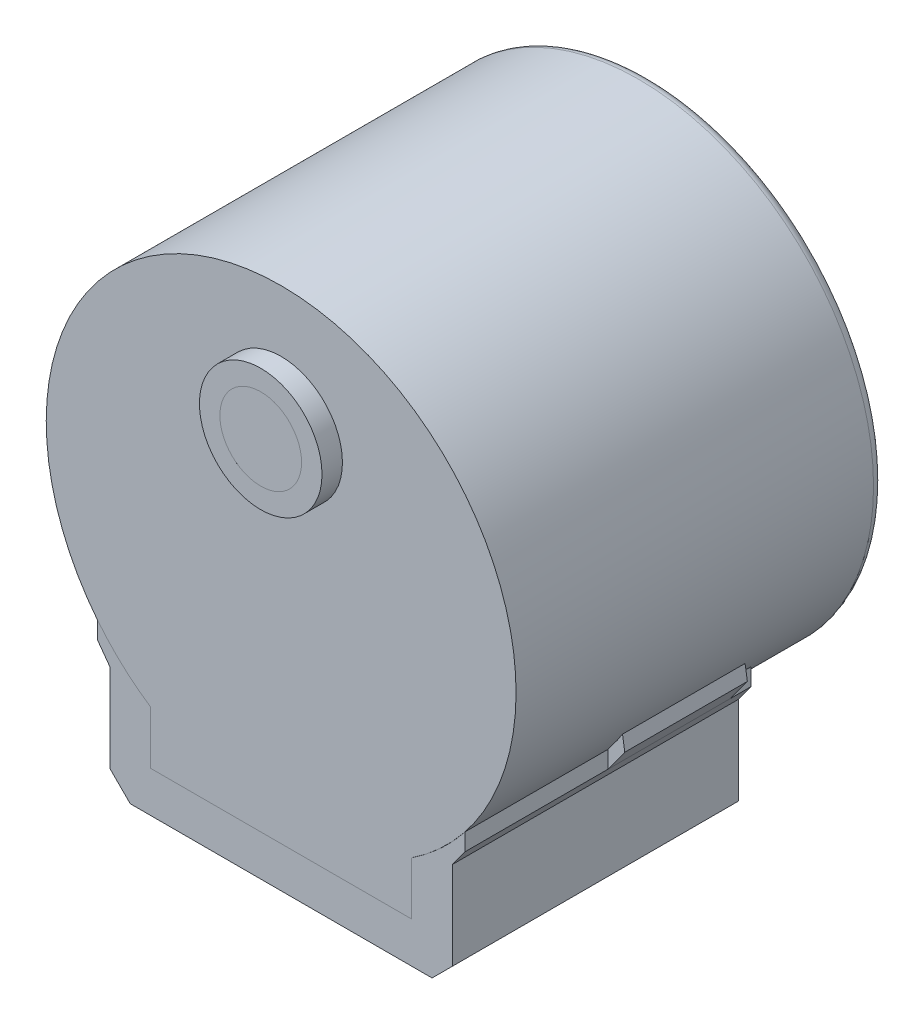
from build123d import *

# Parameters (mm, degrees)
SKETCH1_R             = 11.5
BOSS_EXTRUDE1_DEPTH   = 18
BOSS_EXTRUDE4_DEPTH   = 14
CHAMFER2_SIZE         = 1
BOSS_EXTRUDE5_DEPTH   = 6
BOSS_EXTRUDE5_2_DEPTH = 6
FILLET1_R             = 0.5
BOSS_EXTRUDE9_DEPTH   = 0.0001
SKETCH10_R            = 3
BOSS_EXTRUDE10_DEPTH  = 1
SKETCH12_R            = 2
CUT_EXTRUDE2_DEPTH    = 1
SKETCH6_R             = 3
BOSS_EXTRUDE6_DEPTH   = 1
SKETCH13_R            = 10.326369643
BOSS_EXTRUDE11_DEPTH  = 0.001
BOSS_EXTRUDE13_DEPTH  = 0.0001
BOSS_EXTRUDE14_DEPTH  = 0.0001
BOSS_EXTRUDE15_DEPTH  = 0.0001


with BuildPart() as part:
    # Sketch1 → Boss-Extrude1 (new body)
    with BuildSketch(Plane.XY):
        Circle(SKETCH1_R)
    extrude(amount=BOSS_EXTRUDE1_DEPTH)

    # Sketch2 → Boss-Extrude4 (add)
    with BuildSketch(Plane.XY.offset(18)):
        Polygon((-9, -7.158910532), (9, -7.158910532), (9, -8.001421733), (8.388098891, -8.843932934), (8.388098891, -14.158910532), (-8.388098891, -14.158910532), (-8.388098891, -8.843932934), (-9, -8.001421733), align=None)
    extrude(amount=-BOSS_EXTRUDE4_DEPTH)

    # Chamfer2
    chamfer2_edges = [part.edges().sort_by_distance(p)[0] for p in [
        (8.388098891, -14.158910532, 11),
        (-8.388098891, -14.158910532, 11),
    ]]
    chamfer(chamfer2_edges, length=CHAMFER2_SIZE)

    # Fillet1
    fillet1_edges = [part.edges().sort_by_distance(p)[0] for p in [
        (-11.5, 0, 0),
    ]]
    fillet(fillet1_edges, radius=FILLET1_R)

    # Sketch9 → Boss-Extrude9 (add)
    with BuildSketch(Plane.XY.offset(18)):
        with BuildLine():
            Line((-6.388098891, -9.562541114), (-6.388098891, -12.158910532))
            Line((-6.388098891, -12.158910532), (6.388098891, -12.158910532))
            Line((6.388098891, -12.158910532), (6.388098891, -9.562541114))
            ThreePointArc((6.388098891, -9.562541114), (0, 11.5), (-6.388098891, -9.562541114))
        make_face()
    extrude(amount=BOSS_EXTRUDE9_DEPTH)

    # Sketch10 → Boss-Extrude10 (add)
    with BuildSketch(Plane.XY.offset(18.0001)):
        with Locations((0, 5.5)):
            Circle(SKETCH10_R)
    extrude(amount=BOSS_EXTRUDE10_DEPTH)

    # Sketch12 → Cut-Extrude2 (cut)
    with BuildSketch(Plane.XY.offset(19.0001)):
        with Locations((0, 5.5)):
            Circle(SKETCH12_R)
    extrude(amount=-CUT_EXTRUDE2_DEPTH, mode=Mode.SUBTRACT)

    # Sketch6 → Boss-Extrude6 (add)
    with BuildSketch(Plane.XY.offset(18)):
        with Locations((0, 5.5)):
            Circle(SKETCH6_R)
    extrude(amount=BOSS_EXTRUDE6_DEPTH)

    # Sketch13 → Boss-Extrude11 (add)
    with BuildSketch(Plane(origin=(0, 0, 0), x_dir=(-1, 0, 0), z_dir=(0, 0, -1))):
        with Locations(Location((0, 0, 0), (0, 0, 180))):
            Circle(SKETCH13_R)
    extrude(amount=BOSS_EXTRUDE11_DEPTH)

    # Sketch15 → Boss-Extrude13 (add)
    # profile 1 of 4: a face of its own
    with BuildSketch(Plane(origin=(0, 0, -0.001), x_dir=(-1, 0, 0), z_dir=(0, 0, -1))):
        with BuildLine():
            Line((-3.525948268, 2.886972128), (-3.0540933, 2.886972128))
            add(Edge.make_bspline(
                [(-3.0540933, 2.886972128), (-3.022543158, 2.886821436), (-2.962239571, 2.886533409), (-2.875485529, 2.88481025), (-2.796763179, 2.880101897), (-2.725820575, 2.875989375), (-2.663254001, 2.868436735), (-2.608367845, 2.861342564), (-2.56123852, 2.851756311), (-2.532876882, 2.843220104), (-2.519838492, 2.839295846)],
                knots=[0, 0, 0, 0, 1.407275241, 2.689805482, 3.869373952, 4.924720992, 5.858292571, 6.679408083, 7.392898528, 8, 8, 8, 8], degree=3))
            add(Edge.make_bspline(
                [(-2.519838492, 2.839295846), (-2.502604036, 2.832914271), (-2.467997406, 2.820100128), (-2.418974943, 2.793550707), (-2.37188824, 2.762822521), (-2.327272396, 2.726853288), (-2.286048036, 2.684987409), (-2.246624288, 2.638786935), (-2.21003462, 2.587031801), (-2.176143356, 2.53076706), (-2.144861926, 2.470330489), (-2.11886731, 2.405749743), (-2.095040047, 2.338412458), (-2.07746815, 2.26712436), (-2.062228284, 2.193085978), (-2.053000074, 2.115211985), (-2.046279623, 2.034292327), (-2.045549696, 1.979034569), (-2.045179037, 1.950974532)],
                knots=[0, 0, 0, 0, 0.821157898, 1.648877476, 2.486832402, 3.334190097, 4.20646043, 5.111323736, 6.04828789, 7.037949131, 8.047833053, 9.088416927, 10.149643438, 11.239924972, 12.369590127, 13.528810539, 14.745123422, 16, 16, 16, 16], degree=3))
            add(Edge.make_bspline(
                [(-2.045179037, 1.950974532), (-2.046116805, 1.904405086), (-2.047938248, 1.813952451), (-2.066022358, 1.682720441), (-2.094477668, 1.560029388), (-2.134073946, 1.446505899), (-2.184228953, 1.343791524), (-2.244722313, 1.253250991), (-2.316337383, 1.177008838), (-2.383651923, 1.123712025), (-2.443252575, 1.088860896), (-2.491924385, 1.065731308), (-2.545021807, 1.047222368), (-2.601524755, 1.030643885), (-2.66230531, 1.018402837), (-2.72714964, 1.009288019), (-2.795981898, 1.003635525), (-2.843278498, 1.002790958), (-2.867594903, 1.002356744)],
                knots=[0, 0, 0, 0, 1.559350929, 3.028754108, 4.428415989, 5.773036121, 7.047604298, 8.248499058, 9.406249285, 10.538623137, 11.110667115, 11.716589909, 12.340703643, 12.992445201, 13.688047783, 14.415527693, 15.185381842, 16, 16, 16, 16], degree=3))
            Line((-2.867594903, 1.002356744), (-2.000307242, -0.613027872))
            Line((-2.000307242, -0.613027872), (-2.284962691, -0.613027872))
            Line((-2.284962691, -0.613027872), (-3.152250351, 1.002356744))
            Line((-3.152250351, 1.002356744), (-3.301589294, 1.002356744))
            Line((-3.301589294, 1.002356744), (-3.301589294, -0.613027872))
            Line((-3.301589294, -0.613027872), (-3.525948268, -0.613027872))
            Line((-3.525948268, -0.613027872), (-3.525948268, 2.886972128))
        make_face()
        with BuildLine():
            Line((-3.301589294, 2.527997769), (-3.301589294, 1.361331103))
            Line((-3.301589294, 1.361331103), (-2.880215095, 1.35642325))
            add(Edge.make_bspline(
                [(-2.880215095, 1.35642325), (-2.842090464, 1.357196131), (-2.770770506, 1.358641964), (-2.671720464, 1.369876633), (-2.588225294, 1.389569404), (-2.518805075, 1.418568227), (-2.461788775, 1.458386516), (-2.411484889, 1.505773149), (-2.369914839, 1.564588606), (-2.33317962, 1.630891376), (-2.305485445, 1.704827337), (-2.283683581, 1.78328458), (-2.272141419, 1.866263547), (-2.27041514, 1.922898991), (-2.269538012, 1.951675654)],
                knots=[0, 0, 0, 0, 1.395459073, 2.610493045, 3.641753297, 4.526968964, 5.345645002, 6.17462708, 7.043906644, 7.970450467, 8.942786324, 9.926497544, 10.946446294, 12, 12, 12, 12], degree=3))
            add(Edge.make_bspline(
                [(-2.269538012, 1.951675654), (-2.270296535, 1.979776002), (-2.271789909, 2.035099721), (-2.285050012, 2.115850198), (-2.304755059, 2.193128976), (-2.334707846, 2.264641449), (-2.369232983, 2.33034316), (-2.411159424, 2.386339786), (-2.457612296, 2.433014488), (-2.512091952, 2.469911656), (-2.57845377, 2.49725898), (-2.660457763, 2.514888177), (-2.759506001, 2.52684396), (-2.831559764, 2.527593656), (-2.87039939, 2.527997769)],
                knots=[0, 0, 0, 0, 1.050889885, 2.068982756, 3.055515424, 4.02842232, 4.963806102, 5.826211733, 6.636431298, 7.417566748, 8.27204102, 9.305238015, 10.547424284, 12, 12, 12, 12], degree=3))
            Line((-2.87039939, 2.527997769), (-3.301589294, 2.527997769))
        make_face(mode=Mode.SUBTRACT)
    # profile 2 of 4: a face of its own
    with BuildSketch(Plane(origin=(0, 0, -0.001), x_dir=(-1, 0, 0), z_dir=(0, 0, -1))):
        with BuildLine():
            add(Edge.make_bspline(
                [(-0.743195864, 1.989536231), (-0.710589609, 1.988507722), (-0.64634692, 1.986481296), (-0.552508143, 1.964760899), (-0.462871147, 1.931773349), (-0.37694895, 1.885938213), (-0.296812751, 1.82519744), (-0.220680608, 1.752049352), (-0.147904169, 1.66643579), (-0.105858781, 1.601633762), (-0.084141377, 1.568162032)],
                knots=[0, 0, 0, 0, 0.953316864, 1.878278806, 2.805087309, 3.745143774, 4.718373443, 5.739791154, 6.832550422, 8, 8, 8, 8], degree=3))
            add(Edge.make_bspline(
                [(-0.084141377, 1.568162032), (-0.065135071, 1.535730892), (-0.026928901, 1.47053834), (0.020643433, 1.367200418), (0.062925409, 1.260359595), (0.095391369, 1.148214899), (0.121237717, 1.032040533), (0.140321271, 0.911490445), (0.15173039, 0.786634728), (0.152930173, 0.701833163), (0.153538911, 0.658807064)],
                knots=[0, 0, 0, 0, 0.947011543, 1.903667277, 2.864215, 3.840975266, 4.842905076, 5.862773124, 6.915626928, 8, 8, 8, 8], degree=3))
            add(Edge.make_bspline(
                [(0.153538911, 0.658807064), (0.152619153, 0.615551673), (0.150806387, 0.530298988), (0.139799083, 0.404429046), (0.119809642, 0.282718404), (0.093087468, 0.164844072), (0.056470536, 0.051597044), (0.014464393, -0.058142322), (-0.03757542, -0.162959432), (-0.095405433, -0.263003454), (-0.159659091, -0.354954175), (-0.229469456, -0.435523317), (-0.303185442, -0.504540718), (-0.382558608, -0.560475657), (-0.466219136, -0.604274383), (-0.554422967, -0.635628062), (-0.647294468, -0.65425469), (-0.710859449, -0.656670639), (-0.743195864, -0.657899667)],
                knots=[0, 0, 0, 0, 1.179143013, 2.323990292, 3.440410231, 4.539095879, 5.614957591, 6.682013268, 7.739000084, 8.801004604, 9.829641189, 10.791486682, 11.702119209, 12.575235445, 13.43003252, 14.26821791, 15.119017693, 16, 16, 16, 16], degree=3))
            add(Edge.make_bspline(
                [(-0.743195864, -0.657899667), (-0.775532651, -0.656661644), (-0.839327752, -0.654219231), (-0.932631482, -0.635578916), (-1.021256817, -0.60461203), (-1.104674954, -0.560270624), (-1.183949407, -0.504348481), (-1.258326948, -0.435775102), (-1.328102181, -0.354918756), (-1.392392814, -0.263012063), (-1.450236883, -0.162962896), (-1.502181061, -0.058119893), (-1.544534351, 0.051444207), (-1.57973647, 0.165093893), (-1.607906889, 0.282587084), (-1.627507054, 0.404450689), (-1.638622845, 0.530293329), (-1.640420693, 0.615549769), (-1.641332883, 0.658807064)],
                knots=[0, 0, 0, 0, 0.880385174, 1.73685346, 2.58047298, 3.429050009, 4.301574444, 5.216276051, 6.177469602, 7.205408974, 8.266693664, 9.322964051, 10.389296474, 11.462523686, 12.56192169, 13.677584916, 14.821656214, 16, 16, 16, 16], degree=3))
            add(Edge.make_bspline(
                [(-1.641332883, 0.658807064), (-1.640718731, 0.701599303), (-1.639505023, 0.786166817), (-1.628106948, 0.910788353), (-1.609097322, 1.03111742), (-1.583231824, 1.14683842), (-1.550405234, 1.258609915), (-1.508802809, 1.365486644), (-1.460648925, 1.46856849), (-1.422622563, 1.533611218), (-1.403652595, 1.566058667)],
                knots=[0, 0, 0, 0, 1.08079722, 2.135909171, 3.15796462, 4.156281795, 5.129476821, 6.097590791, 7.050957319, 8, 8, 8, 8], degree=3))
            add(Edge.make_bspline(
                [(-1.403652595, 1.566058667), (-1.381987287, 1.599807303), (-1.340140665, 1.664992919), (-1.266812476, 1.750557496), (-1.191221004, 1.82483722), (-1.109984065, 1.884851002), (-1.024458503, 1.931953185), (-0.934343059, 1.964820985), (-0.840269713, 1.986426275), (-0.775800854, 1.988491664), (-0.743195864, 1.989536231)],
                knots=[0, 0, 0, 0, 1.169336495, 2.258577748, 3.281427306, 4.257001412, 5.197279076, 6.121103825, 7.049752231, 8, 8, 8, 8], degree=3))
        make_face()
        with BuildLine():
            add(Edge.make_bspline(
                [(-0.743896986, 1.675433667), (-0.766642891, 1.674472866), (-0.811637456, 1.67257227), (-0.877710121, 1.657849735), (-0.941216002, 1.634686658), (-1.002359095, 1.601884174), (-1.060621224, 1.55920574), (-1.11685676, 1.507777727), (-1.170439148, 1.446908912), (-1.220012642, 1.377226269), (-1.265938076, 1.301295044), (-1.306866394, 1.220902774), (-1.340185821, 1.136140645), (-1.368742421, 1.048014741), (-1.390226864, 0.955565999), (-1.40528395, 0.859236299), (-1.41584218, 0.759300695), (-1.416592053, 0.69132088), (-1.416973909, 0.656703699)],
                knots=[0, 0, 0, 0, 0.812010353, 1.606269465, 2.406649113, 3.220974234, 4.076097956, 4.98035605, 5.938625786, 6.967482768, 8.03141706, 9.10682197, 10.18594796, 11.281773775, 12.413897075, 13.572437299, 14.763818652, 16, 16, 16, 16], degree=3))
            add(Edge.make_bspline(
                [(-1.416973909, 0.656703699), (-1.415901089, 0.61201679), (-1.41378136, 0.523722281), (-1.396790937, 0.393577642), (-1.367702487, 0.268415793), (-1.329065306, 0.149221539), (-1.280556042, 0.038807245), (-1.223240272, -0.059604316), (-1.158394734, -0.145316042), (-1.085332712, -0.216424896), (-1.006170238, -0.273057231), (-0.922206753, -0.313456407), (-0.834526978, -0.339868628), (-0.774230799, -0.342482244), (-0.743896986, -0.343797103)],
                knots=[0, 0, 0, 0, 1.20838902, 2.38759222, 3.542210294, 4.679604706, 5.771967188, 6.797545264, 7.753349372, 8.669734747, 9.544904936, 10.373258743, 11.181618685, 12, 12, 12, 12], degree=3))
            add(Edge.make_bspline(
                [(-0.743896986, -0.343797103), (-0.713561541, -0.34248469), (-0.65326212, -0.339875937), (-0.565606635, -0.313427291), (-0.481719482, -0.273254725), (-0.403071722, -0.216200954), (-0.330130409, -0.145129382), (-0.264463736, -0.059848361), (-0.207285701, 0.038842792), (-0.158714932, 0.149211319), (-0.120095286, 0.268418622), (-0.091001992, 0.393576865), (-0.074012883, 0.523722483), (-0.071892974, 0.612016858), (-0.070820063, 0.656703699)],
                knots=[0, 0, 0, 0, 0.81846946, 1.626916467, 2.455359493, 3.325471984, 4.241956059, 5.201722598, 6.227411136, 7.319891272, 8.457408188, 9.612150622, 10.791480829, 12, 12, 12, 12], degree=3))
            add(Edge.make_bspline(
                [(-0.070820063, 0.656703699), (-0.071201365, 0.691321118), (-0.071950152, 0.759301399), (-0.082516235, 0.859233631), (-0.097544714, 0.955575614), (-0.119132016, 1.047980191), (-0.14734683, 1.136347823), (-0.182014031, 1.220513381), (-0.221558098, 1.301702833), (-0.268571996, 1.377214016), (-0.31872674, 1.446765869), (-0.372323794, 1.507534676), (-0.427904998, 1.559427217), (-0.486162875, 1.601854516), (-0.547272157, 1.634694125), (-0.610786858, 1.657848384), (-0.676628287, 1.672519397), (-0.721386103, 1.674458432), (-0.743896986, 1.675433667)],
                knots=[0, 0, 0, 0, 1.236632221, 2.428448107, 3.587410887, 4.719947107, 5.816172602, 6.898822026, 7.970883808, 9.039556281, 10.073691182, 11.032310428, 11.93074605, 12.786181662, 13.600803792, 14.401475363, 15.196024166, 16, 16, 16, 16], degree=3))
        make_face(mode=Mode.SUBTRACT)
    # profile 3 of 4: a face of its own
    with BuildSketch(Plane(origin=(0, 0, -0.001), x_dir=(-1, 0, 0), z_dir=(0, 0, -1))):
        Polygon((0.69200045, 2.886972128), (0.916359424, 2.886972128), (0.916359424, 1.451074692), (2.127897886, 1.451074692), (2.127897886, 2.886972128), (2.35225686, 2.886972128), (2.35225686, -0.613027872), (2.127897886, -0.613027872), (2.127897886, 1.092100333), (0.916359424, 1.092100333), (0.916359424, -0.613027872), (0.69200045, -0.613027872), align=None)
    # profile 4 of 4: a face of its own
    with BuildSketch(Plane(origin=(0, 0, -0.001), x_dir=(-1, 0, 0), z_dir=(0, 0, -1))):
        with BuildLine():
            Line((2.711231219, 0.062152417), (2.91455654, 0.239536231))
            add(Edge.make_bspline(
                [(2.91455654, 0.239536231), (2.933533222, 0.193666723), (2.969498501, 0.106733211), (3.030582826, -0.012164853), (3.09314987, -0.113625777), (3.159100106, -0.19622394), (3.226612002, -0.26207911), (3.297620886, -0.308665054), (3.371547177, -0.338400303), (3.422382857, -0.342016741), (3.447409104, -0.343797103)],
                knots=[0, 0, 0, 0, 1.4274707, 2.705392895, 3.841360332, 4.850387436, 5.739695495, 6.54155184, 7.282010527, 8, 8, 8, 8], degree=3))
            add(Edge.make_bspline(
                [(3.447409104, -0.343797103), (3.468781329, -0.342940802), (3.511394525, -0.34123346), (3.573948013, -0.324589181), (3.634791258, -0.29961567), (3.691944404, -0.263292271), (3.745336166, -0.219364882), (3.792361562, -0.167401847), (3.831977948, -0.108132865), (3.864714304, -0.043057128), (3.890203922, 0.026728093), (3.909272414, 0.098967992), (3.920990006, 0.173480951), (3.922171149, 0.223835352), (3.922769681, 0.249351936)],
                knots=[0, 0, 0, 0, 0.910355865, 1.815120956, 2.745047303, 3.708239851, 4.692884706, 5.688582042, 6.687272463, 7.726626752, 8.790156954, 9.852236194, 10.911642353, 12, 12, 12, 12], degree=3))
            add(Edge.make_bspline(
                [(3.922769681, 0.249351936), (3.921592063, 0.278395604), (3.919219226, 0.336917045), (3.902919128, 0.424050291), (3.874284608, 0.510009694), (3.84789866, 0.564886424), (3.834428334, 0.592901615)],
                knots=[0, 0, 0, 0, 0.973184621, 1.960915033, 2.959024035, 4, 4, 4, 4], degree=3))
            add(Edge.make_bspline(
                [(3.834428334, 0.592901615), (3.82343869, 0.612900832), (3.8005507, 0.65455294), (3.760186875, 0.716845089), (3.713582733, 0.782113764), (3.661347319, 0.850711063), (3.601832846, 0.92154823), (3.536813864, 0.995834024), (3.465248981, 1.072970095), (3.414589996, 1.124480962), (3.388514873, 1.150994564)],
                knots=[0, 0, 0, 0, 0.763930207, 1.591027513, 2.483480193, 3.449232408, 4.477278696, 5.580830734, 6.75480852, 8, 8, 8, 8], degree=3))
            add(Edge.make_bspline(
                [(3.388514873, 1.150994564), (3.36238899, 1.177227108), (3.312340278, 1.227480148), (3.243489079, 1.302319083), (3.18061586, 1.36972234), (3.126599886, 1.432552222), (3.079797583, 1.489069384), (3.039778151, 1.539351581), (3.009026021, 1.584984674), (2.991802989, 1.613901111), (2.983967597, 1.627056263)],
                knots=[0, 0, 0, 0, 1.418850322, 2.718056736, 3.897251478, 4.951422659, 5.8930247, 6.710073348, 7.413164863, 8, 8, 8, 8], degree=3))
            add(Edge.make_bspline(
                [(2.983967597, 1.627056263), (2.962706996, 1.668389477), (2.920354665, 1.7507276), (2.877664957, 1.882883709), (2.850290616, 2.019714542), (2.847339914, 2.112799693), (2.845846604, 2.159908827)],
                knots=[0, 0, 0, 0, 1.001108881, 1.994266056, 2.984925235, 4, 4, 4, 4], degree=3))
            add(Edge.make_bspline(
                [(2.845846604, 2.159908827), (2.846742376, 2.19688923), (2.848507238, 2.269748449), (2.863822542, 2.376265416), (2.887141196, 2.478247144), (2.921649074, 2.573727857), (2.964056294, 2.662456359), (3.014983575, 2.74180171), (3.074208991, 2.811129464), (3.140354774, 2.869938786), (3.21278064, 2.916988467), (3.288557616, 2.952119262), (3.368310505, 2.972408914), (3.422292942, 2.975272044), (3.449512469, 2.976715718)],
                knots=[0, 0, 0, 0, 1.181416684, 2.327640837, 3.432896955, 4.519774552, 5.565493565, 6.570422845, 7.524069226, 8.471345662, 9.389213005, 10.275123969, 11.130266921, 12, 12, 12, 12], degree=3))
            add(Edge.make_bspline(
                [(3.449512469, 2.976715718), (3.47841671, 2.975266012), (3.53651374, 2.972352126), (3.621742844, 2.947317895), (3.70329141, 2.906274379), (3.768163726, 2.860173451), (3.818490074, 2.814043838), (3.858027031, 2.772674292), (3.896803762, 2.723610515), (3.937906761, 2.669262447), (3.978012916, 2.607163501), (4.019781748, 2.539244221), (4.060670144, 2.463870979), (4.08807458, 2.4114148), (4.10225686, 2.384267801)],
                knots=[0, 0, 0, 0, 1.116951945, 2.245054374, 3.405965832, 4.638253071, 5.310557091, 6.04630686, 6.850074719, 7.729237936, 8.682511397, 9.709406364, 10.81457734, 12, 12, 12, 12], degree=3))
            Line((4.10225686, 2.384267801), (3.907345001, 2.16902341))
            add(Edge.make_bspline(
                [(3.907345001, 2.16902341), (3.895255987, 2.191026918), (3.872125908, 2.233126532), (3.837775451, 2.293256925), (3.804296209, 2.34702565), (3.771924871, 2.394899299), (3.741171, 2.437098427), (3.711726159, 2.473623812), (3.684038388, 2.504732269), (3.648678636, 2.537114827), (3.604443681, 2.569523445), (3.548315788, 2.597454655), (3.489520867, 2.614434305), (3.449387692, 2.61663385), (3.429179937, 2.617741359)],
                knots=[0, 0, 0, 0, 1.309793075, 2.506045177, 3.612360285, 4.613350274, 5.520539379, 6.33553705, 7.060566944, 7.690470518, 8.834311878, 9.908515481, 10.946901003, 12, 12, 12, 12], degree=3))
            add(Edge.make_bspline(
                [(3.429179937, 2.617741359), (3.403700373, 2.616511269), (3.354017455, 2.614112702), (3.283991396, 2.587729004), (3.22123389, 2.546800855), (3.168184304, 2.490079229), (3.123718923, 2.42324654), (3.093091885, 2.346538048), (3.073476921, 2.263022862), (3.071317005, 2.204662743), (3.070205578, 2.174632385)],
                knots=[0, 0, 0, 0, 0.957930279, 1.867880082, 2.78566855, 3.76545862, 4.778691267, 5.799579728, 6.867730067, 8, 8, 8, 8], degree=3))
            add(Edge.make_bspline(
                [(3.070205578, 2.174632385), (3.072077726, 2.137334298), (3.07581996, 2.062779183), (3.09818308, 1.970782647), (3.125880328, 1.897759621), (3.155352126, 1.841301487), (3.1903723, 1.781686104), (3.218278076, 1.742758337), (3.232865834, 1.722408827)],
                knots=[0, 0, 0, 0, 1.37118372, 2.740858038, 3.459154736, 4.239466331, 5.07968016, 6, 6, 6, 6], degree=3))
            add(Edge.make_bspline(
                [(3.232865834, 1.722408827), (3.238154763, 1.71555867), (3.250729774, 1.699271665), (3.274931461, 1.673318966), (3.305347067, 1.639509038), (3.343672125, 1.599737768), (3.388465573, 1.552236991), (3.441393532, 1.499276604), (3.500882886, 1.438877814), (3.542984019, 1.396376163), (3.565197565, 1.373951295)],
                knots=[0, 0, 0, 0, 0.430988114, 1.024721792, 1.76647773, 2.697202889, 3.776087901, 5.019389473, 6.42735995, 8, 8, 8, 8], degree=3))
            add(Edge.make_bspline(
                [(3.565197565, 1.373951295), (3.591978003, 1.346270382), (3.644064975, 1.292432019), (3.717840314, 1.211657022), (3.785360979, 1.133420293), (3.8455066, 1.056834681), (3.899835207, 0.983156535), (3.947760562, 0.911819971), (3.988542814, 0.842178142), (4.033883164, 0.753567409), (4.078471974, 0.643512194), (4.118610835, 0.511119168), (4.142535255, 0.377824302), (4.145604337, 0.288706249), (4.147128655, 0.244444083)],
                knots=[0, 0, 0, 0, 1.061650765, 2.064871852, 3.015192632, 3.909651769, 4.748487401, 5.538240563, 6.277422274, 6.971787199, 8.280588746, 9.544330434, 10.780345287, 12, 12, 12, 12], degree=3))
            add(Edge.make_bspline(
                [(4.147128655, 0.244444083), (4.146332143, 0.21311157), (4.144759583, 0.151251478), (4.13599318, 0.059965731), (4.119312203, -0.027971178), (4.098030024, -0.113305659), (4.069120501, -0.19532475), (4.033865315, -0.273934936), (3.993113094, -0.349728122), (3.945921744, -0.42085397), (3.894565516, -0.486493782), (3.839952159, -0.544392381), (3.782216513, -0.593299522), (3.721353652, -0.632923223), (3.657801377, -0.664108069), (3.591657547, -0.686650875), (3.522549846, -0.700643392), (3.475520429, -0.702054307), (3.451615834, -0.702771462)],
                knots=[0, 0, 0, 0, 1.158720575, 2.287673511, 3.385950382, 4.465299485, 5.536593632, 6.596465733, 7.64816921, 8.714678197, 9.748443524, 10.726384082, 11.652440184, 12.539243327, 13.404912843, 14.26295822, 15.117078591, 16, 16, 16, 16], degree=3))
            add(Edge.make_bspline(
                [(3.451615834, -0.702771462), (3.433114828, -0.702263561), (3.396386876, -0.701255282), (3.342235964, -0.69221577), (3.289098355, -0.679386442), (3.237953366, -0.65917584), (3.187674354, -0.634492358), (3.138611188, -0.604515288), (3.091418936, -0.568039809), (3.044882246, -0.526698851), (2.999579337, -0.478386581), (2.955739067, -0.422742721), (2.911959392, -0.360278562), (2.870354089, -0.289813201), (2.828748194, -0.21248503), (2.788491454, -0.127602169), (2.748099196, -0.035718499), (2.723779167, 0.02884223), (2.711231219, 0.062152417)],
                knots=[0, 0, 0, 0, 0.781108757, 1.550646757, 2.314652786, 3.086720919, 3.868391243, 4.679628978, 5.511108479, 6.385293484, 7.30741185, 8.305206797, 9.376292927, 10.527882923, 11.760494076, 13.085521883, 14.49627147, 16, 16, 16, 16], degree=3))
        make_face()
    extrude(amount=BOSS_EXTRUDE13_DEPTH)

    # Sketch16 → Boss-Extrude14 (add)
    # profile 1 of 7: a face of its own
    with BuildSketch(Plane(origin=(0, 0, -0.001), x_dir=(-1, 0, 0), z_dir=(0, 0, -1))):
        with BuildLine():
            Line((-2.92792156, 5.936670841), (-3.062536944, 5.936670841))
            add(Edge.make_bspline(
                [(-3.062536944, 5.936670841), (-3.061639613, 5.978280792), (-3.059884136, 6.059683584), (-3.0527546, 6.178701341), (-3.042513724, 6.292178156), (-3.027806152, 6.399760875), (-3.00945665, 6.501952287), (-2.988250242, 6.598549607), (-2.962047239, 6.689249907), (-2.932975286, 6.773583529), (-2.901319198, 6.850131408), (-2.867258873, 6.917256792), (-2.830570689, 6.973676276), (-2.793091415, 7.020898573), (-2.752632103, 7.05717834), (-2.710827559, 7.08411524), (-2.666192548, 7.100667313), (-2.635451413, 7.102449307), (-2.620129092, 7.103337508)],
                knots=[0, 0, 0, 0, 1.499044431, 2.932625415, 4.293837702, 5.602250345, 6.842368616, 8.033041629, 9.162785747, 10.241015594, 11.244734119, 12.144584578, 12.947813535, 13.665690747, 14.309565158, 14.895830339, 15.449648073, 16, 16, 16, 16], degree=3))
            add(Edge.make_bspline(
                [(-2.620129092, 7.103337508), (-2.60505573, 7.102393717), (-2.574878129, 7.100504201), (-2.531160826, 7.084992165), (-2.490667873, 7.059283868), (-2.451362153, 7.025375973), (-2.416201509, 6.98018603), (-2.382114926, 6.926309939), (-2.351200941, 6.862310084), (-2.311516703, 6.76328408), (-2.270172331, 6.625815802), (-2.234790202, 6.448125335), (-2.21369564, 6.256422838), (-2.211240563, 6.124158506), (-2.209972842, 6.055861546)],
                knots=[0, 0, 0, 0, 0.449190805, 0.899301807, 1.365979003, 1.875299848, 2.440824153, 3.06797826, 3.776272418, 4.558816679, 6.251583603, 8.052270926, 9.961522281, 12, 12, 12, 12], degree=3))
            add(Edge.make_bspline(
                [(-2.209972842, 6.055861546), (-2.21068331, 6.007000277), (-2.2120819, 5.910814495), (-2.222031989, 5.768760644), (-2.238518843, 5.631318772), (-2.259214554, 5.518932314), (-2.278702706, 5.427622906), (-2.297419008, 5.353928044), (-2.318079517, 5.274060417), (-2.343002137, 5.188683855), (-2.370084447, 5.097379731), (-2.401262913, 5.000792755), (-2.434786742, 4.898070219), (-2.458999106, 4.827928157), (-2.471491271, 4.79173895)],
                knots=[0, 0, 0, 0, 1.355088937, 2.66755837, 3.947484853, 5.192214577, 5.835517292, 6.536663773, 7.300749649, 8.123430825, 9.003169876, 9.942028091, 10.938206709, 12, 12, 12, 12], degree=3))
            Line((-2.471491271, 4.79173895), (-2.796110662, 3.872568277))
            Line((-2.796110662, 3.872568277), (-2.209972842, 3.872568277))
            Line((-2.209972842, 3.872568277), (-2.209972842, 3.513593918))
            Line((-2.209972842, 3.513593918), (-3.107408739, 3.513593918))
            Line((-3.107408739, 3.513593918), (-2.594888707, 4.962111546))
            add(Edge.make_bspline(
                [(-2.594888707, 4.962111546), (-2.582521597, 4.996706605), (-2.558634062, 5.063528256), (-2.523810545, 5.159961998), (-2.494101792, 5.25001932), (-2.466285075, 5.332758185), (-2.442750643, 5.408819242), (-2.422053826, 5.477901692), (-2.405258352, 5.540100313), (-2.387326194, 5.614207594), (-2.370133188, 5.703652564), (-2.355604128, 5.811557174), (-2.345938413, 5.922238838), (-2.345042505, 5.996946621), (-2.344588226, 6.034827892)],
                knots=[0, 0, 0, 0, 1.193533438, 2.305354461, 3.330536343, 4.274088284, 5.140971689, 5.916908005, 6.616757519, 7.233650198, 8.393579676, 9.573610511, 10.76967679, 12, 12, 12, 12], degree=3))
            add(Edge.make_bspline(
                [(-2.344588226, 6.034827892), (-2.345409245, 6.081612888), (-2.346994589, 6.17195226), (-2.362540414, 6.302485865), (-2.388434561, 6.422874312), (-2.417886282, 6.515836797), (-2.446490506, 6.582344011), (-2.46775217, 6.625427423), (-2.491051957, 6.66164829), (-2.515592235, 6.691508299), (-2.541408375, 6.715037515), (-2.568747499, 6.731728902), (-2.597200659, 6.742129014), (-2.616776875, 6.743624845), (-2.626439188, 6.744363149)],
                knots=[0, 0, 0, 0, 2.062872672, 3.983298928, 5.786766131, 7.488375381, 8.273413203, 8.978743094, 9.604909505, 10.168468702, 10.679523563, 11.137391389, 11.574238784, 12, 12, 12, 12], degree=3))
            add(Edge.make_bspline(
                [(-2.626439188, 6.744363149), (-2.636805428, 6.743666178), (-2.657313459, 6.742287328), (-2.687245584, 6.731689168), (-2.715363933, 6.714496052), (-2.742175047, 6.690863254), (-2.767689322, 6.660913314), (-2.791253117, 6.62381894), (-2.814426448, 6.580637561), (-2.834948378, 6.530600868), (-2.854691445, 6.475245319), (-2.872232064, 6.414177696), (-2.886613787, 6.347576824), (-2.899038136, 6.275713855), (-2.910564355, 6.198648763), (-2.918784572, 6.116051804), (-2.924083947, 6.028093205), (-2.926616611, 5.967758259), (-2.92792156, 5.936670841)],
                knots=[0, 0, 0, 0, 0.539748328, 1.067809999, 1.636377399, 2.249814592, 2.924052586, 3.681314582, 4.537382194, 5.476850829, 6.498438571, 7.601756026, 8.787622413, 10.050065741, 11.404916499, 12.850584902, 14.37727237, 16, 16, 16, 16], degree=3))
        make_face()
    # profile 2 of 7: a face of its own
    with BuildSketch(Plane(origin=(0, 0, -0.001), x_dir=(-1, 0, 0), z_dir=(0, 0, -1))):
        Polygon((-1.384752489, 7.103337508), (-1.357408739, 7.103337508), (-1.357408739, 4.680260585), (-1.17792156, 4.680260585), (-1.17792156, 4.321286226), (-1.357408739, 4.321286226), (-1.357408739, 3.513593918), (-1.492024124, 3.513593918), (-1.492024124, 4.321286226), (-2.075357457, 4.321286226), align=None)
        Polygon((-1.492024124, 4.680260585), (-1.492024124, 6.025713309), (-1.825758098, 4.680260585), align=None, mode=Mode.SUBTRACT)
    # profile 3 of 7: a face of its own
    with BuildSketch(Plane(origin=(0, 0, -0.001), x_dir=(-1, 0, 0), z_dir=(0, 0, -1))):
        with BuildLine():
            Line((-0.90869079, 7.013593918), (-0.63525329, 7.013593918))
            add(Edge.make_bspline(
                [(-0.63525329, 7.013593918), (-0.609171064, 7.012547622), (-0.559507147, 7.01055534), (-0.490050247, 6.991088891), (-0.42949064, 6.959929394), (-0.379297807, 6.913665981), (-0.337330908, 6.854959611), (-0.298720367, 6.784669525), (-0.267854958, 6.699921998), (-0.239903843, 6.603947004), (-0.218229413, 6.498622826), (-0.20174431, 6.386296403), (-0.193087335, 6.268203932), (-0.191533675, 6.187450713), (-0.190742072, 6.146306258)],
                knots=[0, 0, 0, 0, 0.863572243, 1.644352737, 2.372820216, 3.103101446, 3.884767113, 4.75923758, 5.755801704, 6.86996728, 8.074485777, 9.320281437, 10.634660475, 12, 12, 12, 12], degree=3))
            add(Edge.make_bspline(
                [(-0.190742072, 6.146306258), (-0.191341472, 6.107735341), (-0.192512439, 6.032384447), (-0.19987583, 5.921824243), (-0.214201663, 5.816808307), (-0.232651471, 5.717680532), (-0.256351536, 5.625779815), (-0.284532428, 5.542184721), (-0.318817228, 5.467562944), (-0.34685257, 5.423182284), (-0.360413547, 5.401714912)],
                knots=[0, 0, 0, 0, 1.196068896, 2.336601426, 3.433237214, 4.480715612, 5.461496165, 6.373611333, 7.213299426, 8, 8, 8, 8], degree=3))
            add(Edge.make_bspline(
                [(-0.360413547, 5.401714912), (-0.344853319, 5.386154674), (-0.313842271, 5.355143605), (-0.273914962, 5.302681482), (-0.23929722, 5.246348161), (-0.210429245, 5.185272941), (-0.186384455, 5.119240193), (-0.162932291, 5.048075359), (-0.145960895, 4.969612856), (-0.123547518, 4.855163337), (-0.104278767, 4.700267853), (-0.102118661, 4.573053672), (-0.100998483, 4.507083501)],
                knots=[0, 0, 0, 0, 0.690070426, 1.375288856, 2.063485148, 2.762389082, 3.491330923, 4.268542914, 5.111998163, 6.008315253, 7.930009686, 10, 10, 10, 10], degree=3))
            add(Edge.make_bspline(
                [(-0.100998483, 4.507083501), (-0.101437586, 4.472954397), (-0.102298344, 4.406052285), (-0.108005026, 4.307818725), (-0.117042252, 4.213786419), (-0.129503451, 4.123650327), (-0.146231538, 4.037246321), (-0.167416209, 3.955026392), (-0.191052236, 3.876397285), (-0.21875537, 3.803108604), (-0.2491523, 3.735825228), (-0.282397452, 3.67690352), (-0.318509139, 3.62691424), (-0.35700546, 3.585631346), (-0.398695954, 3.553504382), (-0.443112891, 3.530693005), (-0.489852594, 3.515622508), (-0.522260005, 3.514271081), (-0.538498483, 3.513593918)],
                knots=[0, 0, 0, 0, 1.392680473, 2.730023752, 4.013967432, 5.246700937, 6.441860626, 7.603014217, 8.710156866, 9.790649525, 10.797774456, 11.72044125, 12.546415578, 13.308711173, 14.016371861, 14.681771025, 15.339471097, 16, 16, 16, 16], degree=3))
            Line((-0.538498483, 3.513593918), (-0.90869079, 3.513593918))
            Line((-0.90869079, 3.513593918), (-0.90869079, 7.013593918))
        make_face()
        with BuildLine():
            Line((-0.774075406, 6.654619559), (-0.774075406, 5.532824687))
            Line((-0.774075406, 5.532824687), (-0.692745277, 5.532824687))
            add(Edge.make_bspline(
                [(-0.692745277, 5.532824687), (-0.669778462, 5.533522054), (-0.626716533, 5.534829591), (-0.566484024, 5.547249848), (-0.515838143, 5.568671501), (-0.474319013, 5.599807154), (-0.44070983, 5.640372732), (-0.41152634, 5.689711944), (-0.386699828, 5.748928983), (-0.364313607, 5.816081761), (-0.34763362, 5.890884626), (-0.333791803, 5.970114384), (-0.327306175, 6.053885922), (-0.326018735, 6.110775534), (-0.325357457, 6.139996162)],
                knots=[0, 0, 0, 0, 1.027116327, 1.925805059, 2.736260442, 3.468543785, 4.225373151, 5.07935494, 6.02578921, 7.094316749, 8.243810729, 9.452836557, 10.691681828, 12, 12, 12, 12], degree=3))
            add(Edge.make_bspline(
                [(-0.325357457, 6.139996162), (-0.326107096, 6.177886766), (-0.327527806, 6.249696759), (-0.33952374, 6.351149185), (-0.361405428, 6.439552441), (-0.389726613, 6.515653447), (-0.428563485, 6.577922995), (-0.479658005, 6.622815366), (-0.541569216, 6.650709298), (-0.586576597, 6.653280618), (-0.610012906, 6.654619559)],
                knots=[0, 0, 0, 0, 1.382679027, 2.620443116, 3.718891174, 4.699304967, 5.574619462, 6.366550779, 7.149427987, 8, 8, 8, 8], degree=3))
            Line((-0.610012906, 6.654619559), (-0.774075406, 6.654619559))
        make_face(mode=Mode.SUBTRACT)
        with BuildLine():
            Line((-0.774075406, 5.173850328), (-0.774075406, 3.872568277))
            Line((-0.774075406, 3.872568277), (-0.606507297, 3.872568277))
            add(Edge.make_bspline(
                [(-0.606507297, 3.872568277), (-0.583276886, 3.873117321), (-0.539594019, 3.874149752), (-0.479283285, 3.888394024), (-0.428221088, 3.910539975), (-0.387109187, 3.944033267), (-0.353736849, 3.987273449), (-0.324749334, 4.039853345), (-0.297820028, 4.10188108), (-0.276360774, 4.173574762), (-0.258496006, 4.251595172), (-0.244981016, 4.333990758), (-0.237378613, 4.41953285), (-0.236207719, 4.477621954), (-0.235613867, 4.507083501)],
                knots=[0, 0, 0, 0, 1.006422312, 1.892493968, 2.6735037, 3.402484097, 4.167913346, 5.031325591, 6.003981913, 7.098429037, 8.275030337, 9.477812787, 10.720800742, 12, 12, 12, 12], degree=3))
            add(Edge.make_bspline(
                [(-0.235613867, 4.507083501), (-0.236220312, 4.543573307), (-0.237397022, 4.614375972), (-0.2483296, 4.716718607), (-0.264425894, 4.81217852), (-0.289048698, 4.899094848), (-0.318218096, 4.976592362), (-0.353131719, 5.04209609), (-0.393478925, 5.095235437), (-0.426666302, 5.120481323), (-0.442444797, 5.132484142)],
                knots=[0, 0, 0, 0, 1.285587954, 2.494479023, 3.623871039, 4.693059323, 5.673540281, 6.535999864, 7.30396071, 8, 8, 8, 8], degree=3))
            add(Edge.make_bspline(
                [(-0.442444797, 5.132484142), (-0.456509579, 5.139118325), (-0.487967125, 5.153956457), (-0.545583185, 5.164810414), (-0.615390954, 5.17248555), (-0.66653379, 5.173371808), (-0.694147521, 5.173850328)],
                knots=[0, 0, 0, 0, 0.722761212, 1.616540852, 2.713090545, 4, 4, 4, 4], degree=3))
            Line((-0.694147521, 5.173850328), (-0.774075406, 5.173850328))
        make_face(mode=Mode.SUBTRACT)
    # profile 4 of 7: a face of its own
    with BuildSketch(Plane(origin=(0, 0, -0.001), x_dir=(-1, 0, 0), z_dir=(0, 0, -1))):
        Polygon((0.033616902, 7.013593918), (0.193472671, 7.013593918), (0.549642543, 5.555961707), (0.905812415, 7.013593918), (1.065668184, 7.013593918), (0.616950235, 5.177355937), (0.616950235, 3.513593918), (0.482334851, 3.513593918), (0.482334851, 5.177355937), align=None)
    # profile 5 of 7: a face of its own
    with BuildSketch(Plane(origin=(0, 0, -0.001), x_dir=(-1, 0, 0), z_dir=(0, 0, -1))):
        with BuildLine():
            Line((1.649001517, 7.013593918), (1.783616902, 7.013593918))
            Line((1.783616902, 7.013593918), (1.783616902, 4.650112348))
            add(Edge.make_bspline(
                [(1.783616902, 4.650112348), (1.783448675, 4.606408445), (1.783125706, 4.522504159), (1.781617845, 4.401677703), (1.779906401, 4.29134518), (1.776097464, 4.191328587), (1.772333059, 4.101771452), (1.76653513, 4.022319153), (1.760462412, 3.953337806), (1.751518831, 3.876871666), (1.736226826, 3.793317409), (1.713444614, 3.702512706), (1.685737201, 3.621919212), (1.652829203, 3.55289731), (1.6155091, 3.496259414), (1.573148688, 3.454891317), (1.525488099, 3.428115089), (1.491325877, 3.425262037), (1.47442219, 3.423850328)],
                knots=[0, 0, 0, 0, 1.560358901, 2.995631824, 4.314228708, 5.499817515, 6.569028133, 7.514265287, 8.343732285, 9.041296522, 10.262267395, 11.373310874, 12.38138766, 13.299422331, 14.097882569, 14.788424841, 15.400504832, 16, 16, 16, 16], degree=3))
            add(Edge.make_bspline(
                [(1.47442219, 3.423850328), (1.461375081, 3.424957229), (1.434455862, 3.427241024), (1.3956271, 3.446336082), (1.356475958, 3.473858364), (1.318116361, 3.514980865), (1.279277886, 3.569830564), (1.238765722, 3.640515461), (1.197537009, 3.728498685), (1.170141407, 3.79301069), (1.155411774, 3.827696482)],
                knots=[0, 0, 0, 0, 0.578037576, 1.192625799, 1.89385797, 2.702947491, 3.678640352, 4.880947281, 6.322997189, 8, 8, 8, 8], degree=3))
            Line((1.155411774, 3.827696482), (1.225523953, 4.096927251))
            add(Edge.make_bspline(
                [(1.225523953, 4.096927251), (1.240923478, 4.067801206), (1.269402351, 4.013937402), (1.312695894, 3.941126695), (1.350795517, 3.881584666), (1.377211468, 3.848102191), (1.388885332, 3.833305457)],
                knots=[0, 0, 0, 0, 1.272498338, 2.35327519, 3.272271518, 4, 4, 4, 4], degree=3))
            add(Edge.make_bspline(
                [(1.388885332, 3.833305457), (1.395696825, 3.825856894), (1.408477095, 3.811881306), (1.429212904, 3.795413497), (1.450685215, 3.785241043), (1.465214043, 3.783618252), (1.472318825, 3.782824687)],
                knots=[0, 0, 0, 0, 1.205549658, 2.261948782, 3.150070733, 4, 4, 4, 4], degree=3))
            add(Edge.make_bspline(
                [(1.472318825, 3.782824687), (1.481480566, 3.783953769), (1.500654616, 3.786316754), (1.525995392, 3.806110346), (1.550230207, 3.834157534), (1.571592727, 3.873757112), (1.591599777, 3.92190716), (1.609184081, 3.977922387), (1.621895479, 4.041681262), (1.630720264, 4.10026269), (1.636188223, 4.154590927), (1.6395682, 4.204866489), (1.642045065, 4.26379083), (1.645347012, 4.331304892), (1.646139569, 4.407527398), (1.647630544, 4.492358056), (1.649398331, 4.58583673), (1.64913783, 4.651046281), (1.649001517, 4.685168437)],
                knots=[0, 0, 0, 0, 0.453203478, 0.948481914, 1.552314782, 2.305044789, 3.178547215, 4.156720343, 5.23022371, 6.421881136, 7.11399691, 7.956302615, 8.937742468, 10.059090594, 11.331398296, 12.743731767, 14.296094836, 16, 16, 16, 16], degree=3))
            Line((1.649001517, 4.685168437), (1.649001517, 7.013593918))
        make_face()
    # profile 6 of 7: a face of its own
    with BuildSketch(Plane(origin=(0, 0, -0.001), x_dir=(-1, 0, 0), z_dir=(0, 0, -1))):
        Polygon((2.698580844, 7.103337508), (2.725924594, 7.103337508), (2.725924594, 4.680260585), (2.905411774, 4.680260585), (2.905411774, 4.321286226), (2.725924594, 4.321286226), (2.725924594, 3.513593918), (2.59130921, 3.513593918), (2.59130921, 4.321286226), (2.007975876, 4.321286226), align=None)
        Polygon((2.59130921, 4.680260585), (2.59130921, 6.025713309), (2.257575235, 4.680260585), align=None, mode=Mode.SUBTRACT)
    # profile 7 of 7: a face of its own
    with BuildSketch(Plane(origin=(0, 0, -0.001), x_dir=(-1, 0, 0), z_dir=(0, 0, -1))):
        with BuildLine():
            add(Edge.make_bspline(
                [(3.703989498, 5.46341363), (3.725287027, 5.43301942), (3.767899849, 5.372205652), (3.818969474, 5.272149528), (3.85969254, 5.166111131), (3.889639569, 5.053373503), (3.910941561, 4.934136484), (3.925999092, 4.807465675), (3.936356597, 4.672953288), (3.937087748, 4.580488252), (3.937463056, 4.533025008)],
                knots=[0, 0, 0, 0, 0.911357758, 1.82347563, 2.752709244, 3.698923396, 4.685969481, 5.727703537, 6.833607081, 8, 8, 8, 8], degree=3))
            add(Edge.make_bspline(
                [(3.937463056, 4.533025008), (3.936368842, 4.466593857), (3.934241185, 4.337421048), (3.914430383, 4.149865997), (3.885422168, 3.973467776), (3.853003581, 3.862265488), (3.837202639, 3.808065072)],
                knots=[0, 0, 0, 0, 1.084810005, 2.109371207, 3.078500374, 4, 4, 4, 4], degree=3))
            add(Edge.make_bspline(
                [(3.837202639, 3.808065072), (3.826864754, 3.778003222), (3.807204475, 3.720832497), (3.772856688, 3.641753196), (3.733311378, 3.575432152), (3.691409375, 3.520241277), (3.645422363, 3.477471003), (3.596152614, 3.445823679), (3.542290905, 3.427827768), (3.505226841, 3.42517867), (3.486641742, 3.423850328)],
                knots=[0, 0, 0, 0, 1.370372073, 2.60613254, 3.708524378, 4.692028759, 5.583269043, 6.402400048, 7.198912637, 8, 8, 8, 8], degree=3))
            add(Edge.make_bspline(
                [(3.486641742, 3.423850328), (3.468770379, 3.425002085), (3.43351631, 3.427274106), (3.382182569, 3.443370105), (3.334996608, 3.470539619), (3.291176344, 3.508222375), (3.25146848, 3.556757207), (3.214342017, 3.61503335), (3.181490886, 3.684257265), (3.141795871, 3.790669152), (3.100798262, 3.935216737), (3.066352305, 4.117586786), (3.043607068, 4.308094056), (3.041235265, 4.438072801), (3.040027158, 4.504279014)],
                knots=[0, 0, 0, 0, 0.509307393, 1.004688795, 1.518035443, 2.052243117, 2.643591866, 3.299910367, 4.018265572, 4.824047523, 6.536860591, 8.294860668, 10.112743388, 12, 12, 12, 12], degree=3))
            add(Edge.make_bspline(
                [(3.040027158, 4.504279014), (3.040811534, 4.552666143), (3.042340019, 4.646956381), (3.050972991, 4.7846494), (3.067675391, 4.914638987), (3.088313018, 5.038017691), (3.119144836, 5.154662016), (3.160701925, 5.26468955), (3.212845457, 5.368725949), (3.257046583, 5.431886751), (3.27910969, 5.46341363)],
                knots=[0, 0, 0, 0, 1.154596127, 2.249919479, 3.289445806, 4.280461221, 5.232674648, 6.162685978, 7.082899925, 8, 8, 8, 8], degree=3))
            add(Edge.make_bspline(
                [(3.27910969, 5.46341363), (3.263326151, 5.486195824), (3.230973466, 5.532894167), (3.192746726, 5.6115041), (3.158458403, 5.69680902), (3.131784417, 5.78972261), (3.111159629, 5.888226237), (3.095614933, 5.990724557), (3.086313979, 6.096819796), (3.085375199, 6.168723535), (3.084898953, 6.205200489)],
                knots=[0, 0, 0, 0, 0.852833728, 1.748116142, 2.685501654, 3.683571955, 4.72165159, 5.784877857, 6.876262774, 8, 8, 8, 8], degree=3))
            add(Edge.make_bspline(
                [(3.084898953, 6.205200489), (3.085624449, 6.242380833), (3.087068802, 6.316401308), (3.097126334, 6.426939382), (3.113719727, 6.536121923), (3.137654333, 6.642311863), (3.165747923, 6.742579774), (3.200944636, 6.832885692), (3.240736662, 6.912054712), (3.285099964, 6.979641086), (3.33339529, 7.034039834), (3.384943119, 7.073239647), (3.438871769, 7.098755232), (3.476575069, 7.101830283), (3.495055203, 7.103337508)],
                knots=[0, 0, 0, 0, 1.259637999, 2.507749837, 3.757543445, 4.998602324, 6.19395659, 7.282087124, 8.277186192, 9.190785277, 10.014787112, 10.727437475, 11.376258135, 12, 12, 12, 12], degree=3))
            add(Edge.make_bspline(
                [(3.495055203, 7.103337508), (3.513060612, 7.101808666), (3.549849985, 7.098684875), (3.602862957, 7.073270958), (3.652027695, 7.032559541), (3.698761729, 6.978006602), (3.741674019, 6.910232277), (3.780938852, 6.831212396), (3.813264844, 6.740297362), (3.841468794, 6.640737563), (3.864610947, 6.534236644), (3.880262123, 6.423611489), (3.890502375, 6.310326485), (3.891890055, 6.233968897), (3.892591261, 6.195384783)],
                knots=[0, 0, 0, 0, 0.607067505, 1.240384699, 1.949050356, 2.755938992, 3.659365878, 4.65635004, 5.734293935, 6.917908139, 8.155241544, 9.417452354, 10.695017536, 12, 12, 12, 12], degree=3))
            add(Edge.make_bspline(
                [(3.892591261, 6.195384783), (3.892148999, 6.157503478), (3.891287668, 6.083727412), (3.881839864, 5.976277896), (3.867320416, 5.875102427), (3.847276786, 5.780063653), (3.820711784, 5.691649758), (3.788056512, 5.609371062), (3.75026884, 5.532862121), (3.719210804, 5.486255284), (3.703989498, 5.46341363)],
                knots=[0, 0, 0, 0, 1.183887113, 2.305689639, 3.368841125, 4.377612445, 5.339084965, 6.250749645, 7.142705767, 8, 8, 8, 8], degree=3))
        make_face()
        with BuildLine():
            add(Edge.make_bspline(
                [(3.488043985, 6.744363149), (3.478664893, 6.743696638), (3.45989221, 6.742362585), (3.432079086, 6.735472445), (3.405959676, 6.722330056), (3.380852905, 6.704609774), (3.35817124, 6.680834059), (3.33516231, 6.653443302), (3.314484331, 6.620195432), (3.288256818, 6.569062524), (3.259899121, 6.498232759), (3.236316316, 6.405622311), (3.222276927, 6.305423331), (3.220455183, 6.236096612), (3.219514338, 6.200292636)],
                knots=[0, 0, 0, 0, 0.513475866, 1.027745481, 1.553312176, 2.102707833, 2.698820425, 3.343202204, 4.055414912, 4.832377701, 6.483235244, 8.211962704, 10.043657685, 12, 12, 12, 12], degree=3))
            add(Edge.make_bspline(
                [(3.219514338, 6.200292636), (3.220369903, 6.164478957), (3.222050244, 6.094140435), (3.237883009, 5.991133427), (3.263829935, 5.893386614), (3.293454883, 5.816537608), (3.321403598, 5.760395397), (3.34282654, 5.723802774), (3.365573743, 5.692933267), (3.38924361, 5.667907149), (3.413303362, 5.647375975), (3.438997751, 5.633092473), (3.465743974, 5.624294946), (3.484010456, 5.623135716), (3.492951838, 5.622568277)],
                knots=[0, 0, 0, 0, 1.876860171, 3.686177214, 5.448829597, 7.171498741, 7.993538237, 8.735400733, 9.392232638, 9.999034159, 10.538777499, 11.043438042, 11.531766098, 12, 12, 12, 12], degree=3))
            add(Edge.make_bspline(
                [(3.492951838, 5.622568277), (3.504577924, 5.623502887), (3.528606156, 5.625434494), (3.563011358, 5.642672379), (3.59625467, 5.668373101), (3.627577, 5.704102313), (3.656807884, 5.748183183), (3.682223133, 5.800569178), (3.705854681, 5.859627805), (3.729806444, 5.948518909), (3.753534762, 6.06474472), (3.756500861, 6.159956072), (3.757975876, 6.207303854)],
                knots=[0, 0, 0, 0, 0.503458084, 1.04052285, 1.642700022, 2.326910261, 3.09705304, 3.938578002, 4.856542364, 5.861092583, 7.941757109, 10, 10, 10, 10], degree=3))
            add(Edge.make_bspline(
                [(3.757975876, 6.207303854), (3.75726035, 6.240071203), (3.755853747, 6.304486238), (3.7420069, 6.398869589), (3.720180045, 6.489224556), (3.69559859, 6.560944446), (3.6715451, 6.614018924), (3.651070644, 6.648385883), (3.629586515, 6.678269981), (3.605523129, 6.702878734), (3.578493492, 6.720938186), (3.550311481, 6.734725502), (3.519790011, 6.742727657), (3.498840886, 6.743806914), (3.488043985, 6.744363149)],
                knots=[0, 0, 0, 0, 1.795846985, 3.530329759, 5.218164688, 6.888047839, 7.679307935, 8.409016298, 9.078016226, 9.694237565, 10.284317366, 10.851837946, 11.408252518, 12, 12, 12, 12], degree=3))
        make_face(mode=Mode.SUBTRACT)
        with BuildLine():
            add(Edge.make_bspline(
                [(3.495756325, 5.263593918), (3.484434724, 5.262988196), (3.461687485, 5.261771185), (3.429170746, 5.2496175), (3.397964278, 5.231563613), (3.36841021, 5.205776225), (3.340577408, 5.172376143), (3.313969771, 5.132076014), (3.288861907, 5.084806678), (3.256912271, 5.011868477), (3.223833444, 4.91079387), (3.195374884, 4.780431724), (3.17741021, 4.640327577), (3.175583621, 4.543598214), (3.174642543, 4.493762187)],
                knots=[0, 0, 0, 0, 0.453879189, 0.91192917, 1.379723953, 1.899978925, 2.480423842, 3.124712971, 3.840044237, 4.631680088, 6.326916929, 8.109045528, 9.995337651, 12, 12, 12, 12], degree=3))
            add(Edge.make_bspline(
                [(3.174642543, 4.493762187), (3.175293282, 4.462435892), (3.17657208, 4.400875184), (3.183367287, 4.309505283), (3.196293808, 4.221123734), (3.212548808, 4.135973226), (3.233716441, 4.057388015), (3.259064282, 3.986930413), (3.287812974, 3.925746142), (3.321556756, 3.874707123), (3.35836063, 3.834041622), (3.398897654, 3.804879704), (3.442300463, 3.785931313), (3.472907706, 3.783852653), (3.488043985, 3.782824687)],
                knots=[0, 0, 0, 0, 1.34087517, 2.635013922, 3.91797267, 5.161613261, 6.343255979, 7.396897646, 8.36317272, 9.228684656, 10.007177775, 10.695506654, 11.354885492, 12, 12, 12, 12], degree=3))
            add(Edge.make_bspline(
                [(3.488043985, 3.782824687), (3.499808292, 3.783495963), (3.523346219, 3.784839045), (3.557502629, 3.79589941), (3.589621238, 3.813792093), (3.619118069, 3.838923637), (3.646971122, 3.870536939), (3.672470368, 3.909171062), (3.696484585, 3.954783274), (3.726291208, 4.025561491), (3.7566609, 4.123763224), (3.784568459, 4.249581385), (3.799422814, 4.385201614), (3.801681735, 4.478539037), (3.802847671, 4.526714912)],
                knots=[0, 0, 0, 0, 0.485247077, 0.970878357, 1.467991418, 1.995944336, 2.563726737, 3.203848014, 3.903681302, 4.691108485, 6.373855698, 8.142971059, 10.009204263, 12, 12, 12, 12], degree=3))
            add(Edge.make_bspline(
                [(3.802847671, 4.526714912), (3.801801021, 4.573503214), (3.79975814, 4.664825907), (3.782984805, 4.797834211), (3.754003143, 4.922381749), (3.721608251, 5.019688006), (3.69062049, 5.090234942), (3.667037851, 5.136256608), (3.641835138, 5.175170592), (3.615217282, 5.207239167), (3.587053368, 5.232122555), (3.55781984, 5.250323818), (3.52715506, 5.261496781), (3.50612439, 5.26290143), (3.495756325, 5.263593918)],
                knots=[0, 0, 0, 0, 1.972778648, 3.85052346, 5.641228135, 7.358579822, 8.166171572, 8.889162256, 9.537040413, 10.117541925, 10.641396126, 11.114689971, 11.563544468, 12, 12, 12, 12], degree=3))
        make_face(mode=Mode.SUBTRACT)
    extrude(amount=BOSS_EXTRUDE14_DEPTH)

    # Sketch17 → Boss-Extrude15 (add)
    # profile 1 of 5: a face of its own
    with BuildSketch(Plane(origin=(0, 0, -0.001), x_dir=(-1, 0, 0), z_dir=(0, 0, -1))):
        Polygon((-3.264084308, -1.296963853), (-2.917730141, -1.296963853), (-2.917730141, -4.796963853), (-3.097217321, -4.796963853), (-3.097217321, -1.655938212), (-3.36644809, -1.655938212), align=None)
    # profile 2 of 5: a face of its own
    with BuildSketch(Plane(origin=(0, 0, -0.001), x_dir=(-1, 0, 0), z_dir=(0, 0, -1))):
        with BuildLine():
            Line((-2.065166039, -2.37388693), (-2.244653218, -2.37388693))
            add(Edge.make_bspline(
                [(-2.244653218, -2.37388693), (-2.243639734, -2.332268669), (-2.241656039, -2.250809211), (-2.232203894, -2.131775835), (-2.219147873, -2.018263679), (-2.201138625, -1.910553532), (-2.177846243, -1.808289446), (-2.150189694, -1.711678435), (-2.116972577, -1.620954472), (-2.080200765, -1.536545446), (-2.040273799, -1.459750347), (-1.996803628, -1.392844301), (-1.951087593, -1.335831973), (-1.902798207, -1.289354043), (-1.852263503, -1.252496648), (-1.799261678, -1.226221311), (-1.74338721, -1.209790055), (-1.705133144, -1.208081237), (-1.685859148, -1.207220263)],
                knots=[0, 0, 0, 0, 1.425220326, 2.789584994, 4.086897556, 5.336693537, 6.526699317, 7.676472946, 8.775152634, 9.83224548, 10.827367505, 11.735162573, 12.560021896, 13.324106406, 14.023656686, 14.692891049, 15.341423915, 16, 16, 16, 16], degree=3))
            add(Edge.make_bspline(
                [(-1.685859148, -1.207220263), (-1.666836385, -1.208148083), (-1.629139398, -1.209986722), (-1.574341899, -1.225226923), (-1.52310998, -1.250681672), (-1.473877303, -1.284598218), (-1.428648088, -1.32962383), (-1.385301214, -1.38351696), (-1.345907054, -1.447704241), (-1.309153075, -1.520270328), (-1.27615167, -1.599092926), (-1.247223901, -1.682487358), (-1.222880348, -1.769394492), (-1.202437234, -1.859674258), (-1.187119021, -1.953594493), (-1.176130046, -2.050701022), (-1.168673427, -2.151515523), (-1.168048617, -2.21986001), (-1.167730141, -2.254696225)],
                knots=[0, 0, 0, 0, 0.717073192, 1.421008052, 2.127094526, 2.868436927, 3.666818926, 4.526338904, 5.473398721, 6.502909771, 7.593868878, 8.695648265, 9.832044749, 10.998205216, 12.187189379, 13.421248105, 14.685571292, 16, 16, 16, 16], degree=3))
            add(Edge.make_bspline(
                [(-1.167730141, -2.254696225), (-1.168487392, -2.303572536), (-1.169979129, -2.3998558), (-1.183309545, -2.541912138), (-1.202941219, -2.679544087), (-1.228041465, -2.791994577), (-1.253582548, -2.882917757), (-1.276233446, -2.956719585), (-1.301952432, -3.036583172), (-1.332270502, -3.122088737), (-1.366633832, -3.213252), (-1.405385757, -3.309851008), (-1.447544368, -3.41241484), (-1.477105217, -3.48261639), (-1.492349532, -3.518818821)],
                knots=[0, 0, 0, 0, 1.336934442, 2.633676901, 3.900580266, 5.13856045, 5.782375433, 6.484251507, 7.250620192, 8.077746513, 8.966077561, 9.915974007, 10.925282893, 12, 12, 12, 12], degree=3))
            Line((-1.492349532, -3.518818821), (-1.894092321, -4.437989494))
            Line((-1.894092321, -4.437989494), (-1.122858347, -4.437989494))
            Line((-1.122858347, -4.437989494), (-1.122858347, -4.796963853))
            Line((-1.122858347, -4.796963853), (-2.289525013, -4.796963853))
            Line((-2.289525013, -4.796963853), (-1.655710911, -3.348446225))
            add(Edge.make_bspline(
                [(-1.655710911, -3.348446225), (-1.640145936, -3.313919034), (-1.610165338, -3.247414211), (-1.569097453, -3.150320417), (-1.531127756, -3.060724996), (-1.496933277, -2.978042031), (-1.468960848, -2.901607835), (-1.442767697, -2.832919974), (-1.422973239, -2.770389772), (-1.399947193, -2.696669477), (-1.37893953, -2.60713155), (-1.360799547, -2.499176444), (-1.348963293, -2.388405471), (-1.347804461, -2.313620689), (-1.347217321, -2.275729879)],
                knots=[0, 0, 0, 0, 1.210976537, 2.332532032, 3.37069856, 4.32266331, 5.192925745, 5.973117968, 6.672621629, 7.289621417, 8.442385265, 9.609496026, 10.788815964, 12, 12, 12, 12], degree=3))
            add(Edge.make_bspline(
                [(-1.347217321, -2.275729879), (-1.348335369, -2.228919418), (-1.35049751, -2.138394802), (-1.369750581, -2.007654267), (-1.401040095, -1.886847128), (-1.437852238, -1.794206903), (-1.472679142, -1.727746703), (-1.499866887, -1.685047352), (-1.527985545, -1.648345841), (-1.558321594, -1.618791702), (-1.589869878, -1.595009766), (-1.623491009, -1.578727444), (-1.658369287, -1.568322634), (-1.682282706, -1.566905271), (-1.694272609, -1.566194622)],
                knots=[0, 0, 0, 0, 1.969221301, 3.808187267, 5.547434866, 7.21140256, 7.990199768, 8.702353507, 9.339884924, 9.931118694, 10.480007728, 10.994693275, 11.495951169, 12, 12, 12, 12], degree=3))
            add(Edge.make_bspline(
                [(-1.694272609, -1.566194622), (-1.706957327, -1.566900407), (-1.732012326, -1.568294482), (-1.768689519, -1.578573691), (-1.803265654, -1.595614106), (-1.835875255, -1.619629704), (-1.867766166, -1.649017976), (-1.897086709, -1.686265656), (-1.925023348, -1.729689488), (-1.950715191, -1.77960108), (-1.974395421, -1.83518707), (-1.996464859, -1.896088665), (-2.013919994, -1.962934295), (-2.030670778, -2.034537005), (-2.042591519, -2.111961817), (-2.053302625, -2.194445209), (-2.061013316, -2.282396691), (-2.063754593, -2.342790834), (-2.065166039, -2.37388693)],
                knots=[0, 0, 0, 0, 0.632876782, 1.250065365, 1.886803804, 2.547475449, 3.265821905, 4.045882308, 4.906936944, 5.841267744, 6.844957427, 7.92277725, 9.072200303, 10.292429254, 11.593204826, 12.981348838, 14.445738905, 16, 16, 16, 16], degree=3))
        make_face()
    # profile 3 of 5: a face of its own
    with BuildSketch(Plane(origin=(0, 0, -0.001), x_dir=(-1, 0, 0), z_dir=(0, 0, -1))):
        Polygon((-0.943371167, -1.296963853), (-0.747057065, -1.296963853), (-0.158815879, -3.999788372), (0.430827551, -1.296963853), (0.627141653, -1.296963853), (-0.135678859, -4.796963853), (-0.180550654, -4.796963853), align=None)
    # profile 4 of 5: a face of its own
    with BuildSketch(Plane(origin=(0, 0, -0.001), x_dir=(-1, 0, 0), z_dir=(0, 0, -1))):
        with BuildLine():
            Line((1.569449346, -4.796963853), (1.569449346, -1.296963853))
            Line((1.569449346, -1.296963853), (1.92281473, -1.296963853))
            add(Edge.make_bspline(
                [(1.92281473, -1.296963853), (1.953672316, -1.297400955), (2.013103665, -1.298242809), (2.099013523, -1.303715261), (2.178429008, -1.313316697), (2.251232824, -1.32733154), (2.317743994, -1.344573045), (2.377610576, -1.366343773), (2.431263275, -1.391777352), (2.462897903, -1.412976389), (2.478103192, -1.423165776)],
                knots=[0, 0, 0, 0, 1.281000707, 2.467192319, 3.571905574, 4.599406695, 5.543102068, 6.42090934, 7.241004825, 8, 8, 8, 8], degree=3))
            add(Edge.make_bspline(
                [(2.478103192, -1.423165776), (2.498600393, -1.438831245), (2.540392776, -1.470772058), (2.596993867, -1.528691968), (2.65104601, -1.59363756), (2.701075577, -1.667606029), (2.747512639, -1.749367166), (2.791474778, -1.839121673), (2.830964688, -1.937230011), (2.867203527, -2.04308034), (2.900110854, -2.155286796), (2.927970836, -2.273549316), (2.951705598, -2.396834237), (2.971339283, -2.525470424), (2.986628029, -2.659485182), (2.997927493, -2.798835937), (3.004134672, -2.943373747), (3.004938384, -3.041349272), (3.005346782, -3.091134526)],
                knots=[0, 0, 0, 0, 0.685260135, 1.397198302, 2.147595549, 2.930218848, 3.768163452, 4.646505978, 5.58596071, 6.578516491, 7.620899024, 8.694209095, 9.808275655, 10.958859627, 12.153776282, 13.394555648, 14.67607027, 16, 16, 16, 16], degree=3))
            add(Edge.make_bspline(
                [(3.005346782, -3.091134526), (3.005218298, -3.134378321), (3.00496538, -3.21950273), (2.998775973, -3.345024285), (2.990630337, -3.466619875), (2.979059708, -3.584325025), (2.962438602, -3.698074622), (2.943916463, -3.808085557), (2.921485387, -3.914052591), (2.895530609, -4.015500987), (2.867123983, -4.1116729), (2.836075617, -4.20190507), (2.803517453, -4.285498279), (2.768965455, -4.362877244), (2.732171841, -4.433497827), (2.692607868, -4.497380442), (2.65213507, -4.555597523), (2.608424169, -4.606940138), (2.561904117, -4.652875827), (2.510435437, -4.69122593), (2.455015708, -4.724042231), (2.394971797, -4.75063614), (2.330412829, -4.771783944), (2.26125273, -4.786097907), (2.188106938, -4.795667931), (2.13785766, -4.796524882), (2.112117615, -4.796963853)],
                knots=[0, 0, 0, 0, 1.452448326, 2.859110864, 4.220530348, 5.546168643, 6.830721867, 8.08136177, 9.293131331, 10.467946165, 11.598134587, 12.660726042, 13.672480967, 14.610686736, 15.506138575, 16.344979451, 17.133487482, 17.885386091, 18.607130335, 19.324678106, 20.035581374, 20.766532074, 21.526218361, 22.313044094, 23.135861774, 24, 24, 24, 24], degree=3))
            Line((2.112117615, -4.796963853), (1.569449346, -4.796963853))
        make_face()
        with BuildLine():
            Line((1.748936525, -4.437989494), (1.941745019, -4.437989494))
            add(Edge.make_bspline(
                [(1.941745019, -4.437989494), (1.969561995, -4.437746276), (2.022893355, -4.437279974), (2.099621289, -4.433047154), (2.169597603, -4.426237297), (2.233086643, -4.416610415), (2.289909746, -4.403840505), (2.340646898, -4.389719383), (2.384621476, -4.371807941), (2.410028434, -4.356274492), (2.422013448, -4.348947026)],
                knots=[0, 0, 0, 0, 1.350539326, 2.589285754, 3.729692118, 4.763246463, 5.704812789, 6.555872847, 7.318773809, 8, 8, 8, 8], degree=3))
            add(Edge.make_bspline(
                [(2.422013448, -4.348947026), (2.437426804, -4.3375424), (2.468797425, -4.3143307), (2.512723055, -4.273332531), (2.552838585, -4.225113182), (2.592195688, -4.171926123), (2.626527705, -4.11073817), (2.660351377, -4.044573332), (2.691344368, -3.971747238), (2.718976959, -3.892706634), (2.744191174, -3.808282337), (2.765629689, -3.719015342), (2.784759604, -3.625545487), (2.800299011, -3.527323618), (2.811010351, -3.424301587), (2.819351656, -3.316995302), (2.825483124, -3.20525363), (2.825732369, -3.12923748), (2.825859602, -3.090433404)],
                knots=[0, 0, 0, 0, 0.673271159, 1.370300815, 2.104075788, 2.874287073, 3.691008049, 4.564863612, 5.484421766, 6.468562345, 7.505009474, 8.578294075, 9.692499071, 10.856005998, 12.070005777, 13.329995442, 14.63703886, 16, 16, 16, 16], degree=3))
            add(Edge.make_bspline(
                [(2.825859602, -3.090433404), (2.825343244, -3.049530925), (2.824330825, -2.969333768), (2.819708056, -2.8514523), (2.81073173, -2.73822069), (2.796949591, -2.629596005), (2.781503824, -2.525098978), (2.760833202, -2.425300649), (2.737193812, -2.330040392), (2.710100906, -2.23960415), (2.679171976, -2.155316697), (2.646739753, -2.076875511), (2.609857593, -2.00593023), (2.571185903, -1.94123821), (2.528514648, -1.884077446), (2.484058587, -1.833004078), (2.435265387, -1.790047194), (2.400512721, -1.76593336), (2.38345175, -1.754095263)],
                knots=[0, 0, 0, 0, 1.346257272, 2.639595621, 3.882000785, 5.083148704, 6.242796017, 7.357571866, 8.43584699, 9.472439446, 10.462767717, 11.389936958, 12.263723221, 13.092152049, 13.867496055, 14.608465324, 15.316860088, 16, 16, 16, 16], degree=3))
            add(Edge.make_bspline(
                [(2.38345175, -1.754095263), (2.369364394, -1.746042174), (2.340151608, -1.729342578), (2.290740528, -1.709975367), (2.235569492, -1.693497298), (2.174044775, -1.679205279), (2.106016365, -1.669187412), (2.031856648, -1.661616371), (1.951398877, -1.656450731), (1.895713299, -1.656113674), (1.866724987, -1.655938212)],
                knots=[0, 0, 0, 0, 0.731385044, 1.516664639, 2.387367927, 3.328770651, 4.363857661, 5.487699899, 6.692168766, 8, 8, 8, 8], degree=3))
            Line((1.866724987, -1.655938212), (1.748936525, -1.655938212))
            Line((1.748936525, -1.655938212), (1.748936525, -4.437989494))
        make_face(mode=Mode.SUBTRACT)
    # profile 5 of 5: a face of its own
    with BuildSketch(Plane(origin=(0, 0, -0.001), x_dir=(-1, 0, 0), z_dir=(0, 0, -1))):
        with BuildLine():
            Line((4.979705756, -1.939191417), (4.842285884, -2.149527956))
            add(Edge.make_bspline(
                [(4.842285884, -2.149527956), (4.822927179, -2.104315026), (4.78589895, -2.017834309), (4.721129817, -1.899150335), (4.649167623, -1.798474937), (4.572028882, -1.7148119), (4.489906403, -1.648451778), (4.402808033, -1.601163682), (4.311377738, -1.57116948), (4.248423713, -1.567855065), (4.216885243, -1.566194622)],
                knots=[0, 0, 0, 0, 1.299185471, 2.485007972, 3.564697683, 4.560911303, 5.483881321, 6.340461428, 7.168610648, 8, 8, 8, 8], degree=3))
            add(Edge.make_bspline(
                [(4.216885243, -1.566194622), (4.199538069, -1.56661146), (4.164791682, -1.567446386), (4.113600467, -1.578055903), (4.06317886, -1.593381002), (4.013830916, -1.615437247), (3.965597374, -1.643633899), (3.917943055, -1.67762743), (3.872102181, -1.718441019), (3.811095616, -1.781449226), (3.740236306, -1.873104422), (3.666854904, -1.999428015), (3.602036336, -2.141832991), (3.549106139, -2.300627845), (3.506661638, -2.472748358), (3.476027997, -2.656012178), (3.457629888, -2.849805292), (3.455273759, -2.982419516), (3.45406473, -3.050469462)],
                knots=[0, 0, 0, 0, 0.45774643, 0.916866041, 1.375985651, 1.848859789, 2.34149154, 2.850576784, 3.393287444, 3.961145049, 5.167050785, 6.443546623, 7.814561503, 9.295151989, 10.860649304, 12.495527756, 14.201707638, 16, 16, 16, 16], degree=3))
            add(Edge.make_bspline(
                [(3.45406473, -3.050469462), (3.454685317, -3.102139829), (3.455899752, -3.203254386), (3.466940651, -3.351561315), (3.483217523, -3.493230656), (3.507222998, -3.62852866), (3.537756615, -3.757403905), (3.575669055, -3.879936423), (3.620572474, -3.995592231), (3.671111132, -4.103908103), (3.727481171, -4.202116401), (3.787179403, -4.288959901), (3.851588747, -4.36202508), (3.91898156, -4.422437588), (3.99059614, -4.469901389), (4.066401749, -4.502654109), (4.145540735, -4.524669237), (4.199910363, -4.526704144), (4.22740207, -4.527733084)],
                knots=[0, 0, 0, 0, 1.361066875, 2.663493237, 3.915974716, 5.116529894, 6.281377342, 7.403118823, 8.492786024, 9.54768219, 10.548887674, 11.472965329, 12.319202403, 13.108680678, 13.851549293, 14.571113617, 15.277491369, 16, 16, 16, 16], degree=3))
            add(Edge.make_bspline(
                [(4.22740207, -4.527733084), (4.257531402, -4.525999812), (4.317878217, -4.522528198), (4.405836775, -4.493326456), (4.489680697, -4.446963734), (4.568864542, -4.381427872), (4.644002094, -4.298202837), (4.715368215, -4.197076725), (4.782692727, -4.077753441), (4.821759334, -3.990332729), (4.842285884, -3.944399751)],
                knots=[0, 0, 0, 0, 0.803819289, 1.609990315, 2.451669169, 3.353266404, 4.343836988, 5.441246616, 6.655568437, 8, 8, 8, 8], degree=3))
            Line((4.842285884, -3.944399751), (4.979705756, -4.152632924))
            add(Edge.make_bspline(
                [(4.979705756, -4.152632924), (4.96873234, -4.18101291), (4.947154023, -4.236819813), (4.911349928, -4.316934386), (4.874497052, -4.392708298), (4.83392206, -4.462550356), (4.793336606, -4.528931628), (4.748674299, -4.588976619), (4.703194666, -4.644783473), (4.655626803, -4.695421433), (4.606032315, -4.740055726), (4.555132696, -4.779333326), (4.502538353, -4.811974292), (4.448954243, -4.840030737), (4.393369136, -4.861070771), (4.336185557, -4.875611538), (4.277746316, -4.885319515), (4.238191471, -4.886242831), (4.218287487, -4.886707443)],
                knots=[0, 0, 0, 0, 1.296200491, 2.548871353, 3.737868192, 4.884022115, 5.989127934, 7.050667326, 8.069356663, 9.055503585, 10.007320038, 10.90950695, 11.790846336, 12.641442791, 13.482897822, 14.316123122, 15.152673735, 16, 16, 16, 16], degree=3))
            add(Edge.make_bspline(
                [(4.218287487, -4.886707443), (4.180930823, -4.884848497), (4.107180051, -4.881178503), (4.000039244, -4.8508989), (3.899193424, -4.802633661), (3.804669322, -4.734643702), (3.717527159, -4.646748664), (3.636145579, -4.540606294), (3.56073716, -4.415339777), (3.518344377, -4.323007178), (3.496132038, -4.274628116)],
                knots=[0, 0, 0, 0, 0.889987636, 1.757043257, 2.634913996, 3.546251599, 4.520108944, 5.577402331, 6.730643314, 8, 8, 8, 8], degree=3))
            add(Edge.make_bspline(
                [(3.496132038, -4.274628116), (3.478230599, -4.230679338), (3.441892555, -4.141467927), (3.398002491, -4.001495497), (3.358697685, -3.855515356), (3.328716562, -3.702401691), (3.303517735, -3.542993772), (3.287563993, -3.376742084), (3.276410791, -3.203933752), (3.275196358, -3.086479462), (3.274577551, -3.026631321)],
                knots=[0, 0, 0, 0, 0.892200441, 1.811073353, 2.756806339, 3.734396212, 4.744014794, 5.791127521, 6.874482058, 8, 8, 8, 8], degree=3))
            add(Edge.make_bspline(
                [(3.274577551, -3.026631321), (3.275352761, -2.963742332), (3.276873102, -2.840404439), (3.289757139, -2.659280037), (3.310568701, -2.485847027), (3.339800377, -2.320043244), (3.378014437, -2.161930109), (3.422802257, -2.010915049), (3.478082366, -1.868000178), (3.540327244, -1.733844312), (3.608650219, -1.61131732), (3.682080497, -1.503795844), (3.760497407, -1.413070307), (3.842441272, -1.337688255), (3.929525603, -1.27900965), (4.021309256, -1.237881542), (4.117329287, -1.212075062), (4.183072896, -1.208846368), (4.216184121, -1.207220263)],
                knots=[0, 0, 0, 0, 1.350883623, 2.649353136, 3.89856053, 5.102044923, 6.263763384, 7.391449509, 8.483282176, 9.552439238, 10.566269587, 11.493781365, 12.344403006, 13.137041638, 13.879228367, 14.589340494, 15.289532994, 16, 16, 16, 16], degree=3))
            add(Edge.make_bspline(
                [(4.216184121, -1.207220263), (4.236318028, -1.207700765), (4.276330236, -1.208655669), (4.335575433, -1.218138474), (4.393114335, -1.233527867), (4.449023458, -1.255118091), (4.504121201, -1.2812408), (4.556612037, -1.315901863), (4.608593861, -1.354736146), (4.658406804, -1.400176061), (4.706670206, -1.45032842), (4.752339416, -1.506091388), (4.795400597, -1.566720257), (4.838323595, -1.630881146), (4.875950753, -1.701610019), (4.913717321, -1.77603659), (4.948584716, -1.855626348), (4.969222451, -1.911042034), (4.979705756, -1.939191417)],
                knots=[0, 0, 0, 0, 0.856532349, 1.702190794, 2.54685376, 3.387581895, 4.250790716, 5.136691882, 6.059960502, 7.01095472, 8.003107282, 9.020916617, 10.075690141, 11.16844244, 12.303884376, 13.482947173, 14.721418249, 16, 16, 16, 16], degree=3))
        make_face()
    extrude(amount=BOSS_EXTRUDE15_DEPTH)


with BuildPart() as body_2:
    # Sketch4 → Boss-Extrude5 (new body)
    with BuildSketch(Plane(origin=(0, 0, 5), x_dir=(-1, 0, 0), z_dir=(0, 0, -1))):
        Polygon((-9, -8.001421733), (-9.822575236, -6.868838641), (-9.710355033, -6.161087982), (-9, -7.158910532), align=None)
    extrude(amount=-BOSS_EXTRUDE5_DEPTH)


with BuildPart() as body_3:
    # Sketch4 → Boss-Extrude5 2 (new body)
    with BuildSketch(Plane(origin=(0, 0, 5), x_dir=(-1, 0, 0), z_dir=(0, 0, -1))):
        Polygon((9, -7.158910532), (9, -8.001421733), (9.822575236, -6.868838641), (9.710355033, -6.161087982), align=None)
    extrude(amount=-BOSS_EXTRUDE5_2_DEPTH)


solid = Compound([part.part, body_2.part, body_3.part])
